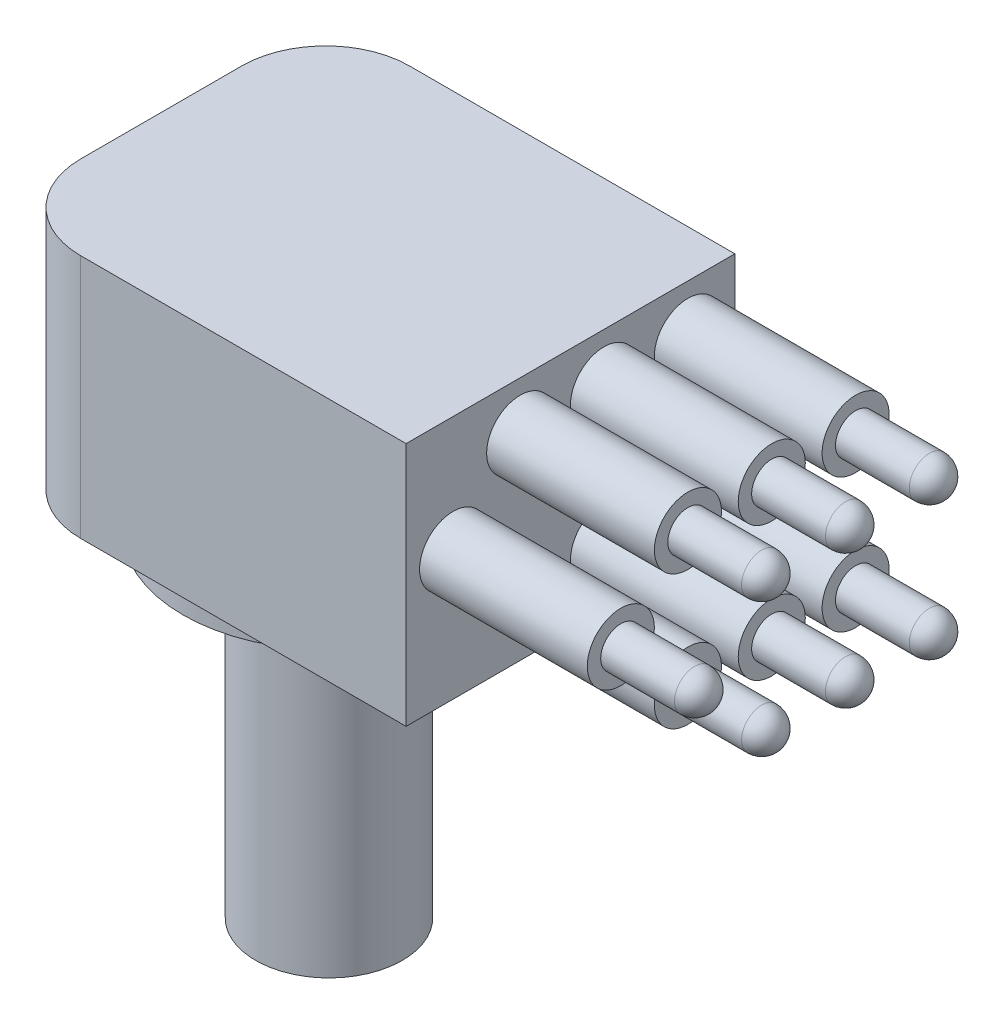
from build123d import *

# Parameters (mm, degrees)
SKETCH1_W           = 30.988
SKETCH1_H           = 18.542
BASE_EXTRUDE_DEPTH  = 24.892
SKETCH2_R           = 11.049
BOSS_EXTRUDE1_DEPTH = 2.54
SKETCH3_R           = 5.55625
BOSS_EXTRUDE2_DEPTH = 25.4
FILLET3_R           = 6.35
SKETCH4_R           = 2.54
BOSS_EXTRUDE3_DEPTH = 12.7
SKETCH5_R           = 1.524
BOSS_EXTRUDE4_DEPTH = 7.112
FILLET5_R           = 1.524


with BuildPart() as part:
    # Sketch1 → Base-Extrude (new body)
    with BuildSketch(Plane.XY):
        with Locations((15.494, 9.271)):
            Rectangle(SKETCH1_W, SKETCH1_H)
    extrude(amount=BASE_EXTRUDE_DEPTH)

    # Sketch2 → Boss-Extrude1 (add)
    with BuildSketch(Plane.XZ):
        with Locations(Location((12.7, 12.446, 0), (0, 0, 90))):
            Circle(SKETCH2_R)
    extrude(amount=BOSS_EXTRUDE1_DEPTH)

    # Sketch3 → Boss-Extrude2 (add)
    with BuildSketch(Plane.XZ.offset(2.54)):
        with Locations(Location((12.7, 12.446, 0), (0, 0, 270))):
            Circle(SKETCH3_R)
    extrude(amount=BOSS_EXTRUDE2_DEPTH)

    # Fillet3
    fillet3_edges = [part.edges().sort_by_distance(p)[0] for p in [
        (0, 9.271, 0),
        (0, 9.271, 24.892),
    ]]
    fillet(fillet3_edges, radius=FILLET3_R)

    # Sketch4 → Boss-Extrude3 (add)
    with BuildSketch(Plane(origin=(30.988, 0, 0), x_dir=(0, 0, -1), z_dir=(1, 0, 0))):
        with Locations(Location((-21.336, 9.779, 0), (0, 0, 180))):
            Circle(SKETCH4_R)
        with Locations(Location((-16.256, 14.859, 0), (0, 0, 180))):
            Circle(SKETCH4_R)
        with Locations(Location((-9.906, 14.859, 0), (0, 0, 180))):
            Circle(SKETCH4_R)
        with Locations(Location((-3.556, 14.859, 0), (0, 0, 180))):
            Circle(SKETCH4_R)
        with Locations(Location((-16.256, 4.699, 0), (0, 0, 180))):
            Circle(SKETCH4_R)
        with Locations(Location((-9.906, 4.699, 0), (0, 0, 180))):
            Circle(SKETCH4_R)
        with Locations(Location((-3.556, 4.699, 0), (0, 0, 180))):
            Circle(SKETCH4_R)
    extrude(amount=BOSS_EXTRUDE3_DEPTH)

    # Sketch5 → Boss-Extrude4 (add)
    with BuildSketch(Plane(origin=(43.688, 0, 0), x_dir=(0, 0, -1), z_dir=(1, 0, 0))):
        with Locations(Location((-21.336, 9.779, 0), (0, 0, 180))):
            Circle(SKETCH5_R)
        with Locations(Location((-16.256, 14.859, 0), (0, 0, 180))):
            Circle(SKETCH5_R)
        with Locations(Location((-9.906, 14.859, 0), (0, 0, 180))):
            Circle(SKETCH5_R)
        with Locations(Location((-3.556, 14.859, 0), (0, 0, 180))):
            Circle(SKETCH5_R)
        with Locations(Location((-16.256, 4.699, 0), (0, 0, 180))):
            Circle(SKETCH5_R)
        with Locations(Location((-9.906, 4.699, 0), (0, 0, 180))):
            Circle(SKETCH5_R)
        with Locations(Location((-3.556, 4.699, 0), (0, 0, 180))):
            Circle(SKETCH5_R)
    extrude(amount=BOSS_EXTRUDE4_DEPTH)

    # Fillet5
    fillet5_edges = [part.edges().sort_by_distance(p)[0] for p in [
        (50.8, 4.699, 14.732),
        (50.8, 9.779, 19.812),
        (50.8, 14.859, 14.732),
        (50.8, 4.699, 8.382),
        (50.8, 4.699, 2.032),
        (50.8, 14.859, 8.382),
        (50.8, 14.859, 2.032),
    ]]
    fillet(fillet5_edges, radius=FILLET5_R)


solid = part.part
